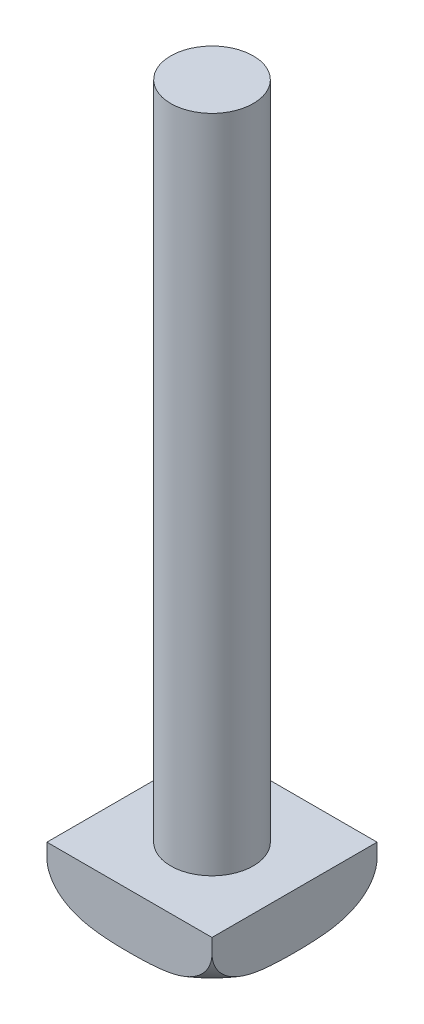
from build123d import *

# Parameters (mm, degrees)
SKETCH1_R      = 6
EXTRUDE1_DEPTH = 96
SKETCH2_W      = 24
SKETCH2_H      = 24
EXTRUDE2_DEPTH = 8


with BuildPart() as part:
    # Sketch1 → Extrude1 (new body)
    with BuildSketch(Plane(origin=(0, 0, 0), x_dir=(1, 0, 0), z_dir=(0, 1, 0))):
        with Locations(Location((0, 0, 0), (0, 0, 270))):
            Circle(SKETCH1_R)
    extrude(amount=EXTRUDE1_DEPTH)

    # Sketch2 → Extrude2 (add)
    with BuildSketch(Plane(origin=(0, 0, 0), x_dir=(1, 0, 0), z_dir=(0, 1, 0))):
        Rectangle(SKETCH2_W, SKETCH2_H)
    extrude(amount=-EXTRUDE2_DEPTH)

    # Sketch5 → Cut-Revolve1 (revolve, cut)
    with BuildSketch(Plane(origin=(0, 0, 0), x_dir=(-0.6109554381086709, -0.5034549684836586, -0.6109554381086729), z_dir=(-0.7071067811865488, 0, 0.7071067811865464)), mode=Mode.PRIVATE) as cut_revolve1_sk:
        with BuildLine():
            Line((-4.893852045, 12.067619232), (-3.509772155, 14.442955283))
            Line((-3.509772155, 14.442955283), (-10.473793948, 18.50080744))
            Line((-10.473793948, 18.50080744), (-14.85989926, 10.973442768))
            Line((-14.85989926, 10.973442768), (-13.656020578, 10.271957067))
            ThreePointArc((-13.656020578, 10.271957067), (-9.676458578, 13.129068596), (-4.893852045, 12.067619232))
        make_face()
    revolve(cut_revolve1_sk.sketch.rotate(Axis((0, 0, 0), (0, -1, 0)), 45), axis=Axis((0, 0, 0), (0, -1, 0)), mode=Mode.SUBTRACT)


solid = part.part
